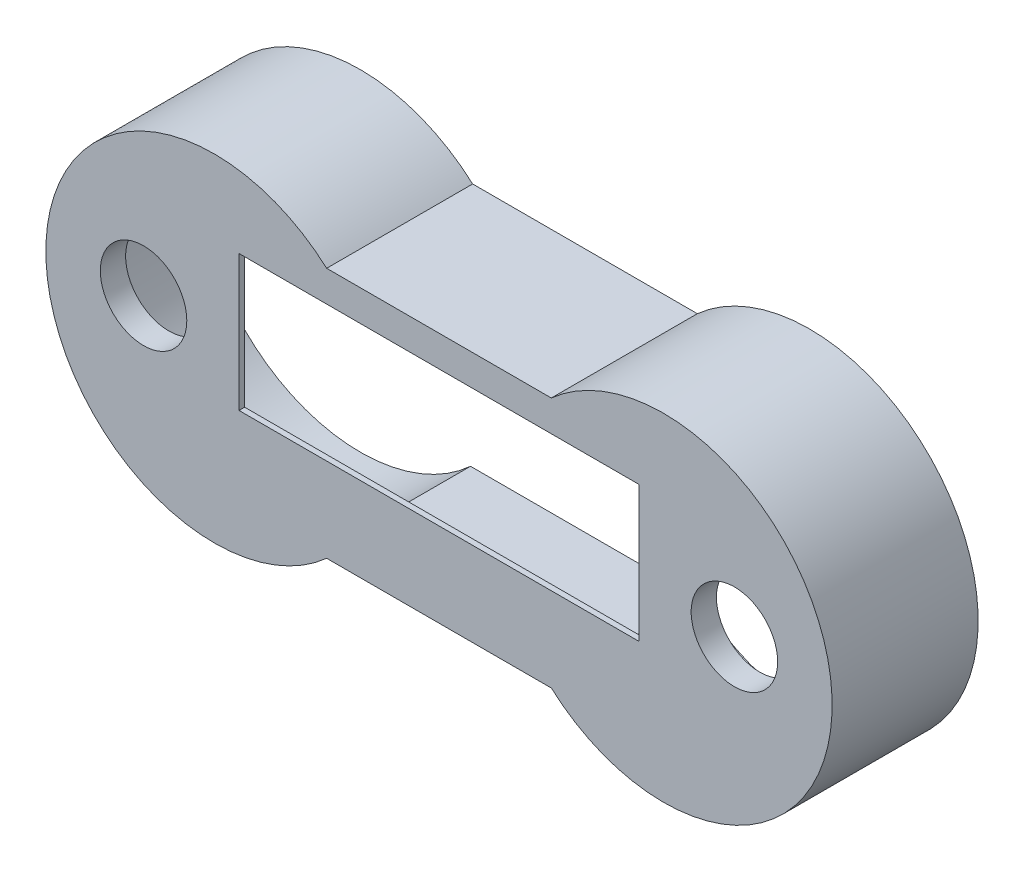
ISO-10303-21;
HEADER;
FILE_DESCRIPTION(('STEP AP214'),'2;1');
FILE_NAME('part.step','',(''),(''),'','','');
FILE_SCHEMA(('AUTOMOTIVE_DESIGN { 1 0 10303 214 1 1 1 1 }'));
ENDSEC;
DATA;
#1=APPLICATION_CONTEXT('core data for automotive mechanical design processes');
#2=APPLICATION_PROTOCOL_DEFINITION('international standard','automotive_design',2000,#1);
#3=PRODUCT_CONTEXT('',#1,'mechanical');
#4=PRODUCT('Part','Part','',(#3));
#5=PRODUCT_RELATED_PRODUCT_CATEGORY('part','',(#4));
#6=PRODUCT_DEFINITION_FORMATION('','',#4);
#7=PRODUCT_DEFINITION_CONTEXT('part definition',#1,'design');
#8=PRODUCT_DEFINITION('design','',#6,#7);
#9=PRODUCT_DEFINITION_SHAPE('','',#8);
#10=(LENGTH_UNIT() NAMED_UNIT(*) SI_UNIT(.MILLI.,.METRE.));
#11=(NAMED_UNIT(*) PLANE_ANGLE_UNIT() SI_UNIT($,.RADIAN.));
#12=(NAMED_UNIT(*) SI_UNIT($,.STERADIAN.) SOLID_ANGLE_UNIT());
#13=UNCERTAINTY_MEASURE_WITH_UNIT(LENGTH_MEASURE(1.E-05),#10,'distance_accuracy_value','');
#14=(GEOMETRIC_REPRESENTATION_CONTEXT(3) GLOBAL_UNCERTAINTY_ASSIGNED_CONTEXT((#13)) GLOBAL_UNIT_ASSIGNED_CONTEXT((#10,
#11,#12)) REPRESENTATION_CONTEXT('',''));
#15=CARTESIAN_POINT('',(0.,0.,0.));
#16=DIRECTION('',(0.,0.,1.));
#17=DIRECTION('',(1.,0.,0.));
#18=AXIS2_PLACEMENT_3D('',#15,#16,#17);
#19=CARTESIAN_POINT('',(30.,29.8606797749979,25.));
#20=DIRECTION('',(0.,0.,1.));
#21=DIRECTION('',(1.,0.,0.));
#22=AXIS2_PLACEMENT_3D('',#19,#20,#21);
#23=PLANE('',#22);
#24=CARTESIAN_POINT('',(122.6,31.7,25.));
#25=DIRECTION('',(0.,0.,1.));
#26=DIRECTION('',(1.,0.,0.));
#27=AXIS2_PLACEMENT_3D('',#24,#25,#26);
#28=CIRCLE('',#27,8.7);
#29=CARTESIAN_POINT('',(131.3,31.7,25.));
#30=VERTEX_POINT('',#29);
#31=EDGE_CURVE('E40',#30,#30,#28,.F.);
#32=ORIENTED_EDGE('',*,*,#31,.F.);
#33=EDGE_LOOP('',(#32));
#34=FACE_BOUND('',#33,.T.);
#35=DIRECTION('',(-1.,0.,0.));
#36=VECTOR('',#35,1.);
#37=CARTESIAN_POINT('',(30.,46.7,25.));
#38=LINE('',#37,#36);
#39=CARTESIAN_POINT('',(105.6,46.7,25.));
#40=VERTEX_POINT('',#39);
#41=CARTESIAN_POINT('',(34.4,46.7,25.));
#42=VERTEX_POINT('',#41);
#43=EDGE_CURVE('E152',#40,#42,#38,.T.);
#44=ORIENTED_EDGE('',*,*,#43,.T.);
#45=DIRECTION('',(0.,-1.,0.));
#46=VECTOR('',#45,1.);
#47=CARTESIAN_POINT('',(34.4,29.8606797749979,25.));
#48=LINE('',#47,#46);
#49=CARTESIAN_POINT('',(34.4,22.5,25.));
#50=VERTEX_POINT('',#49);
#51=EDGE_CURVE('E155',#42,#50,#48,.T.);
#52=ORIENTED_EDGE('',*,*,#51,.T.);
#53=DIRECTION('',(1.,0.,0.));
#54=VECTOR('',#53,1.);
#55=CARTESIAN_POINT('',(30.,22.5,25.));
#56=LINE('',#55,#54);
#57=CARTESIAN_POINT('',(105.6,22.5,25.));
#58=VERTEX_POINT('',#57);
#59=EDGE_CURVE('E147',#50,#58,#56,.T.);
#60=ORIENTED_EDGE('',*,*,#59,.T.);
#61=DIRECTION('',(0.,1.,0.));
#62=VECTOR('',#61,1.);
#63=CARTESIAN_POINT('',(105.6,29.8606797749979,25.));
#64=LINE('',#63,#62);
#65=EDGE_CURVE('E127',#58,#40,#64,.T.);
#66=ORIENTED_EDGE('',*,*,#65,.T.);
#67=EDGE_LOOP('',(#44,#52,#60,#66));
#68=FACE_BOUND('',#67,.T.);
#69=CARTESIAN_POINT('',(30.,29.8606797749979,25.));
#70=DIRECTION('',(0.,0.,1.));
#71=DIRECTION('',(1.,0.,0.));
#72=AXIS2_PLACEMENT_3D('',#69,#70,#71);
#73=CIRCLE('',#72,29.);
#74=CARTESIAN_POINT('',(49.6143151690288,51.2213595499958,25.));
#75=VERTEX_POINT('',#74);
#76=CARTESIAN_POINT('',(49.6143151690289,8.5,25.));
#77=VERTEX_POINT('',#76);
#78=EDGE_CURVE('E171',#75,#77,#73,.T.);
#79=ORIENTED_EDGE('',*,*,#78,.F.);
#80=DIRECTION('',(-1.,0.,0.));
#81=VECTOR('',#80,1.);
#82=CARTESIAN_POINT('',(49.6143151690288,51.2213595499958,25.));
#83=LINE('',#82,#81);
#84=CARTESIAN_POINT('',(90.3856848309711,51.2213595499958,25.));
#85=VERTEX_POINT('',#84);
#86=EDGE_CURVE('E181',#85,#75,#83,.T.);
#87=ORIENTED_EDGE('',*,*,#86,.F.);
#88=CARTESIAN_POINT('',(110.,29.8606797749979,25.));
#89=DIRECTION('',(0.,0.,1.));
#90=DIRECTION('',(-1.,0.,0.));
#91=AXIS2_PLACEMENT_3D('',#88,#89,#90);
#92=CIRCLE('',#91,29.);
#93=CARTESIAN_POINT('',(90.3856848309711,8.5,25.));
#94=VERTEX_POINT('',#93);
#95=EDGE_CURVE('E178',#94,#85,#92,.T.);
#96=ORIENTED_EDGE('',*,*,#95,.F.);
#97=DIRECTION('',(1.,0.,0.));
#98=VECTOR('',#97,1.);
#99=CARTESIAN_POINT('',(49.6143151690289,8.5,25.));
#100=LINE('',#99,#98);
#101=EDGE_CURVE('E174',#77,#94,#100,.T.);
#102=ORIENTED_EDGE('',*,*,#101,.F.);
#103=EDGE_LOOP('',(#79,#87,#96,#102));
#104=FACE_BOUND('',#103,.T.);
#105=CARTESIAN_POINT('',(17.4,31.7,25.));
#106=DIRECTION('',(0.,0.,1.));
#107=DIRECTION('',(1.,0.,0.));
#108=AXIS2_PLACEMENT_3D('',#105,#106,#107);
#109=CIRCLE('',#108,8.7);
#110=CARTESIAN_POINT('',(26.1,31.7,25.));
#111=VERTEX_POINT('',#110);
#112=EDGE_CURVE('E11',#111,#111,#109,.F.);
#113=ORIENTED_EDGE('',*,*,#112,.F.);
#114=EDGE_LOOP('',(#113));
#115=FACE_BOUND('',#114,.T.);
#116=ADVANCED_FACE('F32',(#34,#68,#104,#115),#23,.F.);
#117=CARTESIAN_POINT('',(30.,29.8606797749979,0.));
#118=DIRECTION('',(0.,0.,1.));
#119=DIRECTION('',(1.,0.,0.));
#120=AXIS2_PLACEMENT_3D('',#117,#118,#119);
#121=PLANE('',#120);
#122=CARTESIAN_POINT('',(30.,29.8606797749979,0.));
#123=DIRECTION('',(0.,0.,1.));
#124=DIRECTION('',(1.,0.,0.));
#125=AXIS2_PLACEMENT_3D('',#122,#123,#124);
#126=CIRCLE('',#125,30.);
#127=CARTESIAN_POINT('',(50.,52.2213595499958,0.));
#128=VERTEX_POINT('',#127);
#129=CARTESIAN_POINT('',(50.,7.5,0.));
#130=VERTEX_POINT('',#129);
#131=EDGE_CURVE('E204',#128,#130,#126,.T.);
#132=ORIENTED_EDGE('',*,*,#131,.F.);
#133=DIRECTION('',(-1.,0.,0.));
#134=VECTOR('',#133,1.);
#135=CARTESIAN_POINT('',(50.,52.2213595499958,0.));
#136=LINE('',#135,#134);
#137=CARTESIAN_POINT('',(90.,52.2213595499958,0.));
#138=VERTEX_POINT('',#137);
#139=EDGE_CURVE('E211',#138,#128,#136,.T.);
#140=ORIENTED_EDGE('',*,*,#139,.F.);
#141=CARTESIAN_POINT('',(110.,29.8606797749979,0.));
#142=DIRECTION('',(0.,0.,1.));
#143=DIRECTION('',(-1.,0.,0.));
#144=AXIS2_PLACEMENT_3D('',#141,#142,#143);
#145=CIRCLE('',#144,30.);
#146=CARTESIAN_POINT('',(90.,7.5,0.));
#147=VERTEX_POINT('',#146);
#148=EDGE_CURVE('E209',#147,#138,#145,.T.);
#149=ORIENTED_EDGE('',*,*,#148,.F.);
#150=DIRECTION('',(1.,0.,0.));
#151=VECTOR('',#150,1.);
#152=CARTESIAN_POINT('',(50.,7.5,0.));
#153=LINE('',#152,#151);
#154=EDGE_CURVE('E207',#130,#147,#153,.T.);
#155=ORIENTED_EDGE('',*,*,#154,.F.);
#156=EDGE_LOOP('',(#132,#140,#149,#155));
#157=FACE_BOUND('',#156,.T.);
#158=CARTESIAN_POINT('',(30.,29.8606797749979,0.));
#159=DIRECTION('',(0.,0.,1.));
#160=DIRECTION('',(1.,0.,0.));
#161=AXIS2_PLACEMENT_3D('',#158,#159,#160);
#162=CIRCLE('',#161,29.);
#163=CARTESIAN_POINT('',(49.6143151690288,51.2213595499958,0.));
#164=VERTEX_POINT('',#163);
#165=CARTESIAN_POINT('',(49.6143151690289,8.5,0.));
#166=VERTEX_POINT('',#165);
#167=EDGE_CURVE('E170',#164,#166,#162,.T.);
#168=ORIENTED_EDGE('',*,*,#167,.T.);
#169=DIRECTION('',(1.,0.,0.));
#170=VECTOR('',#169,1.);
#171=CARTESIAN_POINT('',(49.6143151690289,8.5,0.));
#172=LINE('',#171,#170);
#173=CARTESIAN_POINT('',(90.3856848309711,8.50000000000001,0.));
#174=VERTEX_POINT('',#173);
#175=EDGE_CURVE('E187',#166,#174,#172,.T.);
#176=ORIENTED_EDGE('',*,*,#175,.T.);
#177=CARTESIAN_POINT('',(110.,29.8606797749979,0.));
#178=DIRECTION('',(0.,0.,1.));
#179=DIRECTION('',(-1.,0.,0.));
#180=AXIS2_PLACEMENT_3D('',#177,#178,#179);
#181=CIRCLE('',#180,29.);
#182=CARTESIAN_POINT('',(90.3856848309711,51.2213595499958,0.));
#183=VERTEX_POINT('',#182);
#184=EDGE_CURVE('E190',#174,#183,#181,.T.);
#185=ORIENTED_EDGE('',*,*,#184,.T.);
#186=DIRECTION('',(-1.,0.,0.));
#187=VECTOR('',#186,1.);
#188=CARTESIAN_POINT('',(49.6143151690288,51.2213595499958,0.));
#189=LINE('',#188,#187);
#190=EDGE_CURVE('E175',#183,#164,#189,.T.);
#191=ORIENTED_EDGE('',*,*,#190,.T.);
#192=EDGE_LOOP('',(#168,#176,#185,#191));
#193=FACE_BOUND('',#192,.T.);
#194=ADVANCED_FACE('F231',(#157,#193),#121,.F.);
#195=CARTESIAN_POINT('',(30.,29.8606797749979,25.));
#196=DIRECTION('',(0.,0.,-1.));
#197=DIRECTION('',(-1.,0.,0.));
#198=AXIS2_PLACEMENT_3D('',#195,#196,#197);
#199=CYLINDRICAL_SURFACE('',#198,30.);
#200=ORIENTED_EDGE('',*,*,#131,.T.);
#201=DIRECTION('',(0.,0.,-1.));
#202=VECTOR('',#201,1.);
#203=CARTESIAN_POINT('',(50.,7.5,25.));
#204=LINE('',#203,#202);
#205=CARTESIAN_POINT('',(50.,7.5,26.));
#206=VERTEX_POINT('',#205);
#207=EDGE_CURVE('E222',#206,#130,#204,.T.);
#208=ORIENTED_EDGE('',*,*,#207,.F.);
#209=CARTESIAN_POINT('',(30.,29.8606797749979,26.));
#210=DIRECTION('',(0.,0.,1.));
#211=DIRECTION('',(1.,0.,0.));
#212=AXIS2_PLACEMENT_3D('',#209,#210,#211);
#213=CIRCLE('',#212,30.);
#214=CARTESIAN_POINT('',(50.,52.2213595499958,26.));
#215=VERTEX_POINT('',#214);
#216=EDGE_CURVE('E158',#215,#206,#213,.T.);
#217=ORIENTED_EDGE('',*,*,#216,.F.);
#218=DIRECTION('',(0.,0.,-1.));
#219=VECTOR('',#218,1.);
#220=CARTESIAN_POINT('',(50.,52.2213595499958,25.));
#221=LINE('',#220,#219);
#222=EDGE_CURVE('E213',#215,#128,#221,.T.);
#223=ORIENTED_EDGE('',*,*,#222,.T.);
#224=EDGE_LOOP('',(#200,#208,#217,#223));
#225=FACE_BOUND('',#224,.T.);
#226=ADVANCED_FACE('F34',(#225),#199,.T.);
#227=CARTESIAN_POINT('',(50.,7.5,25.));
#228=DIRECTION('',(0.,1.,0.));
#229=DIRECTION('',(0.,0.,1.));
#230=AXIS2_PLACEMENT_3D('',#227,#228,#229);
#231=PLANE('',#230);
#232=ORIENTED_EDGE('',*,*,#154,.T.);
#233=DIRECTION('',(0.,0.,-1.));
#234=VECTOR('',#233,1.);
#235=CARTESIAN_POINT('',(90.,7.5,25.));
#236=LINE('',#235,#234);
#237=CARTESIAN_POINT('',(90.,7.5,26.));
#238=VERTEX_POINT('',#237);
#239=EDGE_CURVE('E219',#238,#147,#236,.T.);
#240=ORIENTED_EDGE('',*,*,#239,.F.);
#241=DIRECTION('',(1.,0.,0.));
#242=VECTOR('',#241,1.);
#243=CARTESIAN_POINT('',(50.,7.5,26.));
#244=LINE('',#243,#242);
#245=EDGE_CURVE('E161',#206,#238,#244,.T.);
#246=ORIENTED_EDGE('',*,*,#245,.F.);
#247=ORIENTED_EDGE('',*,*,#207,.T.);
#248=EDGE_LOOP('',(#232,#240,#246,#247));
#249=FACE_BOUND('',#248,.T.);
#250=ADVANCED_FACE('F303',(#249),#231,.F.);
#251=CARTESIAN_POINT('',(110.,29.8606797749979,25.));
#252=DIRECTION('',(0.,0.,-1.));
#253=DIRECTION('',(-1.,0.,0.));
#254=AXIS2_PLACEMENT_3D('',#251,#252,#253);
#255=CYLINDRICAL_SURFACE('',#254,30.);
#256=ORIENTED_EDGE('',*,*,#148,.T.);
#257=DIRECTION('',(0.,0.,-1.));
#258=VECTOR('',#257,1.);
#259=CARTESIAN_POINT('',(90.,52.2213595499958,25.));
#260=LINE('',#259,#258);
#261=CARTESIAN_POINT('',(90.,52.2213595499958,26.));
#262=VERTEX_POINT('',#261);
#263=EDGE_CURVE('E216',#262,#138,#260,.T.);
#264=ORIENTED_EDGE('',*,*,#263,.F.);
#265=CARTESIAN_POINT('',(110.,29.8606797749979,26.));
#266=DIRECTION('',(0.,0.,1.));
#267=DIRECTION('',(1.,0.,0.));
#268=AXIS2_PLACEMENT_3D('',#265,#266,#267);
#269=CIRCLE('',#268,30.);
#270=EDGE_CURVE('E164',#238,#262,#269,.T.);
#271=ORIENTED_EDGE('',*,*,#270,.F.);
#272=ORIENTED_EDGE('',*,*,#239,.T.);
#273=EDGE_LOOP('',(#256,#264,#271,#272));
#274=FACE_BOUND('',#273,.T.);
#275=ADVANCED_FACE('F300',(#274),#255,.T.);
#276=CARTESIAN_POINT('',(50.,52.2213595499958,25.));
#277=DIRECTION('',(0.,-1.,0.));
#278=DIRECTION('',(0.,0.,-1.));
#279=AXIS2_PLACEMENT_3D('',#276,#277,#278);
#280=PLANE('',#279);
#281=ORIENTED_EDGE('',*,*,#139,.T.);
#282=ORIENTED_EDGE('',*,*,#222,.F.);
#283=DIRECTION('',(-1.,0.,0.));
#284=VECTOR('',#283,1.);
#285=CARTESIAN_POINT('',(90.,52.2213595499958,26.));
#286=LINE('',#285,#284);
#287=EDGE_CURVE('E167',#262,#215,#286,.T.);
#288=ORIENTED_EDGE('',*,*,#287,.F.);
#289=ORIENTED_EDGE('',*,*,#263,.T.);
#290=EDGE_LOOP('',(#281,#282,#288,#289));
#291=FACE_BOUND('',#290,.T.);
#292=ADVANCED_FACE('F293',(#291),#280,.F.);
#293=CARTESIAN_POINT('',(30.,29.8606797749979,25.));
#294=DIRECTION('',(0.,0.,-1.));
#295=DIRECTION('',(-1.,0.,0.));
#296=AXIS2_PLACEMENT_3D('',#293,#294,#295);
#297=CYLINDRICAL_SURFACE('',#296,29.);
#298=ORIENTED_EDGE('',*,*,#167,.F.);
#299=DIRECTION('',(0.,0.,-1.));
#300=VECTOR('',#299,1.);
#301=CARTESIAN_POINT('',(49.6143151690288,51.2213595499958,25.));
#302=LINE('',#301,#300);
#303=EDGE_CURVE('E184',#75,#164,#302,.T.);
#304=ORIENTED_EDGE('',*,*,#303,.F.);
#305=ORIENTED_EDGE('',*,*,#78,.T.);
#306=DIRECTION('',(0.,0.,-1.));
#307=VECTOR('',#306,1.);
#308=CARTESIAN_POINT('',(49.6143151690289,8.5,25.));
#309=LINE('',#308,#307);
#310=EDGE_CURVE('E201',#77,#166,#309,.T.);
#311=ORIENTED_EDGE('',*,*,#310,.T.);
#312=EDGE_LOOP('',(#298,#304,#305,#311));
#313=FACE_BOUND('',#312,.T.);
#314=ADVANCED_FACE('F289',(#313),#297,.F.);
#315=CARTESIAN_POINT('',(49.6143151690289,8.5,25.));
#316=DIRECTION('',(0.,1.,0.));
#317=DIRECTION('',(0.,0.,1.));
#318=AXIS2_PLACEMENT_3D('',#315,#316,#317);
#319=PLANE('',#318);
#320=ORIENTED_EDGE('',*,*,#175,.F.);
#321=ORIENTED_EDGE('',*,*,#310,.F.);
#322=ORIENTED_EDGE('',*,*,#101,.T.);
#323=DIRECTION('',(0.,0.,-1.));
#324=VECTOR('',#323,1.);
#325=CARTESIAN_POINT('',(90.3856848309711,8.50000000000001,25.));
#326=LINE('',#325,#324);
#327=EDGE_CURVE('E199',#94,#174,#326,.T.);
#328=ORIENTED_EDGE('',*,*,#327,.T.);
#329=EDGE_LOOP('',(#320,#321,#322,#328));
#330=FACE_BOUND('',#329,.T.);
#331=ADVANCED_FACE('F285',(#330),#319,.T.);
#332=CARTESIAN_POINT('',(110.,29.8606797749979,25.));
#333=DIRECTION('',(0.,0.,-1.));
#334=DIRECTION('',(-1.,0.,0.));
#335=AXIS2_PLACEMENT_3D('',#332,#333,#334);
#336=CYLINDRICAL_SURFACE('',#335,29.);
#337=ORIENTED_EDGE('',*,*,#184,.F.);
#338=ORIENTED_EDGE('',*,*,#327,.F.);
#339=ORIENTED_EDGE('',*,*,#95,.T.);
#340=DIRECTION('',(0.,0.,-1.));
#341=VECTOR('',#340,1.);
#342=CARTESIAN_POINT('',(90.3856848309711,51.2213595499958,25.));
#343=LINE('',#342,#341);
#344=EDGE_CURVE('E197',#85,#183,#343,.T.);
#345=ORIENTED_EDGE('',*,*,#344,.T.);
#346=EDGE_LOOP('',(#337,#338,#339,#345));
#347=FACE_BOUND('',#346,.T.);
#348=ADVANCED_FACE('F281',(#347),#336,.F.);
#349=CARTESIAN_POINT('',(49.6143151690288,51.2213595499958,25.));
#350=DIRECTION('',(0.,-1.,0.));
#351=DIRECTION('',(0.,0.,-1.));
#352=AXIS2_PLACEMENT_3D('',#349,#350,#351);
#353=PLANE('',#352);
#354=ORIENTED_EDGE('',*,*,#190,.F.);
#355=ORIENTED_EDGE('',*,*,#344,.F.);
#356=ORIENTED_EDGE('',*,*,#86,.T.);
#357=ORIENTED_EDGE('',*,*,#303,.T.);
#358=EDGE_LOOP('',(#354,#355,#356,#357));
#359=FACE_BOUND('',#358,.T.);
#360=ADVANCED_FACE('F276',(#359),#353,.T.);
#361=CARTESIAN_POINT('',(30.,29.8606797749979,26.));
#362=DIRECTION('',(0.,0.,1.));
#363=DIRECTION('',(1.,0.,0.));
#364=AXIS2_PLACEMENT_3D('',#361,#362,#363);
#365=PLANE('',#364);
#366=CARTESIAN_POINT('',(122.6,31.7,26.));
#367=DIRECTION('',(0.,0.,1.));
#368=DIRECTION('',(1.,0.,0.));
#369=AXIS2_PLACEMENT_3D('',#366,#367,#368);
#370=CIRCLE('',#369,7.69999999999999);
#371=CARTESIAN_POINT('',(130.3,31.7,26.));
#372=VERTEX_POINT('',#371);
#373=EDGE_CURVE('E468',#372,#372,#370,.T.);
#374=ORIENTED_EDGE('',*,*,#373,.F.);
#375=EDGE_LOOP('',(#374));
#376=FACE_BOUND('',#375,.T.);
#377=CARTESIAN_POINT('',(17.4,31.7,26.));
#378=DIRECTION('',(0.,0.,1.));
#379=DIRECTION('',(1.,0.,0.));
#380=AXIS2_PLACEMENT_3D('',#377,#378,#379);
#381=CIRCLE('',#380,7.69999999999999);
#382=CARTESIAN_POINT('',(25.1,31.7,26.));
#383=VERTEX_POINT('',#382);
#384=EDGE_CURVE('E471',#383,#383,#381,.T.);
#385=ORIENTED_EDGE('',*,*,#384,.F.);
#386=EDGE_LOOP('',(#385));
#387=FACE_BOUND('',#386,.T.);
#388=DIRECTION('',(0.,-1.,0.));
#389=VECTOR('',#388,1.);
#390=CARTESIAN_POINT('',(34.4,46.7,26.));
#391=LINE('',#390,#389);
#392=CARTESIAN_POINT('',(34.4,46.7,26.));
#393=VERTEX_POINT('',#392);
#394=CARTESIAN_POINT('',(34.4,22.5,26.));
#395=VERTEX_POINT('',#394);
#396=EDGE_CURVE('E55',#393,#395,#391,.T.);
#397=ORIENTED_EDGE('',*,*,#396,.F.);
#398=DIRECTION('',(-1.,0.,0.));
#399=VECTOR('',#398,1.);
#400=CARTESIAN_POINT('',(34.4,46.7,26.));
#401=LINE('',#400,#399);
#402=CARTESIAN_POINT('',(105.6,46.7,26.));
#403=VERTEX_POINT('',#402);
#404=EDGE_CURVE('E140',#403,#393,#401,.T.);
#405=ORIENTED_EDGE('',*,*,#404,.F.);
#406=DIRECTION('',(0.,1.,0.));
#407=VECTOR('',#406,1.);
#408=CARTESIAN_POINT('',(105.6,46.7,26.));
#409=LINE('',#408,#407);
#410=CARTESIAN_POINT('',(105.6,22.5,26.));
#411=VERTEX_POINT('',#410);
#412=EDGE_CURVE('E124',#411,#403,#409,.T.);
#413=ORIENTED_EDGE('',*,*,#412,.F.);
#414=DIRECTION('',(1.,0.,0.));
#415=VECTOR('',#414,1.);
#416=CARTESIAN_POINT('',(34.4,22.5,26.));
#417=LINE('',#416,#415);
#418=EDGE_CURVE('E133',#395,#411,#417,.T.);
#419=ORIENTED_EDGE('',*,*,#418,.F.);
#420=EDGE_LOOP('',(#397,#405,#413,#419));
#421=FACE_BOUND('',#420,.T.);
#422=ORIENTED_EDGE('',*,*,#216,.T.);
#423=ORIENTED_EDGE('',*,*,#245,.T.);
#424=ORIENTED_EDGE('',*,*,#270,.T.);
#425=ORIENTED_EDGE('',*,*,#287,.T.);
#426=EDGE_LOOP('',(#422,#423,#424,#425));
#427=FACE_BOUND('',#426,.T.);
#428=ADVANCED_FACE('F137',(#376,#387,#421,#427),#365,.T.);
#429=CARTESIAN_POINT('',(34.4,46.7,0.));
#430=DIRECTION('',(-1.,0.,0.));
#431=DIRECTION('',(0.,0.,1.));
#432=AXIS2_PLACEMENT_3D('',#429,#430,#431);
#433=PLANE('',#432);
#434=DIRECTION('',(0.,0.,1.));
#435=VECTOR('',#434,1.);
#436=CARTESIAN_POINT('',(34.4,46.7,0.));
#437=LINE('',#436,#435);
#438=EDGE_CURVE('E145',#42,#393,#437,.T.);
#439=ORIENTED_EDGE('',*,*,#438,.T.);
#440=ORIENTED_EDGE('',*,*,#396,.T.);
#441=DIRECTION('',(0.,0.,1.));
#442=VECTOR('',#441,1.);
#443=CARTESIAN_POINT('',(34.4,22.5,0.));
#444=LINE('',#443,#442);
#445=EDGE_CURVE('E130',#50,#395,#444,.T.);
#446=ORIENTED_EDGE('',*,*,#445,.F.);
#447=ORIENTED_EDGE('',*,*,#51,.F.);
#448=EDGE_LOOP('',(#439,#440,#446,#447));
#449=FACE_BOUND('',#448,.T.);
#450=ADVANCED_FACE('F267',(#449),#433,.F.);
#451=CARTESIAN_POINT('',(34.4,46.7,0.));
#452=DIRECTION('',(0.,1.,0.));
#453=DIRECTION('',(0.,0.,1.));
#454=AXIS2_PLACEMENT_3D('',#451,#452,#453);
#455=PLANE('',#454);
#456=DIRECTION('',(0.,0.,1.));
#457=VECTOR('',#456,1.);
#458=CARTESIAN_POINT('',(105.6,46.7,0.));
#459=LINE('',#458,#457);
#460=EDGE_CURVE('E129',#40,#403,#459,.T.);
#461=ORIENTED_EDGE('',*,*,#460,.T.);
#462=ORIENTED_EDGE('',*,*,#404,.T.);
#463=ORIENTED_EDGE('',*,*,#438,.F.);
#464=ORIENTED_EDGE('',*,*,#43,.F.);
#465=EDGE_LOOP('',(#461,#462,#463,#464));
#466=FACE_BOUND('',#465,.T.);
#467=ADVANCED_FACE('F264',(#466),#455,.F.);
#468=CARTESIAN_POINT('',(105.6,46.7,0.));
#469=DIRECTION('',(1.,0.,0.));
#470=DIRECTION('',(0.,0.,-1.));
#471=AXIS2_PLACEMENT_3D('',#468,#469,#470);
#472=PLANE('',#471);
#473=DIRECTION('',(0.,0.,1.));
#474=VECTOR('',#473,1.);
#475=CARTESIAN_POINT('',(105.6,22.5,0.));
#476=LINE('',#475,#474);
#477=EDGE_CURVE('E47',#58,#411,#476,.T.);
#478=ORIENTED_EDGE('',*,*,#477,.T.);
#479=ORIENTED_EDGE('',*,*,#412,.T.);
#480=ORIENTED_EDGE('',*,*,#460,.F.);
#481=ORIENTED_EDGE('',*,*,#65,.F.);
#482=EDGE_LOOP('',(#478,#479,#480,#481));
#483=FACE_BOUND('',#482,.T.);
#484=ADVANCED_FACE('F121',(#483),#472,.F.);
#485=CARTESIAN_POINT('',(34.4,22.5,0.));
#486=DIRECTION('',(0.,-1.,0.));
#487=DIRECTION('',(0.,0.,-1.));
#488=AXIS2_PLACEMENT_3D('',#485,#486,#487);
#489=PLANE('',#488);
#490=ORIENTED_EDGE('',*,*,#445,.T.);
#491=ORIENTED_EDGE('',*,*,#418,.T.);
#492=ORIENTED_EDGE('',*,*,#477,.F.);
#493=ORIENTED_EDGE('',*,*,#59,.F.);
#494=EDGE_LOOP('',(#490,#491,#492,#493));
#495=FACE_BOUND('',#494,.T.);
#496=ADVANCED_FACE('F134',(#495),#489,.F.);
#497=CARTESIAN_POINT('',(17.4,31.7,0.));
#498=DIRECTION('',(0.,0.,1.));
#499=DIRECTION('',(1.,0.,0.));
#500=AXIS2_PLACEMENT_3D('',#497,#498,#499);
#501=CYLINDRICAL_SURFACE('',#500,7.69999999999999);
#502=ORIENTED_EDGE('',*,*,#384,.T.);
#503=EDGE_LOOP('',(#502));
#504=FACE_BOUND('',#503,.T.);
#505=CARTESIAN_POINT('',(17.4,31.7,21.5));
#506=DIRECTION('',(0.,0.,-1.));
#507=DIRECTION('',(-1.,0.,0.));
#508=AXIS2_PLACEMENT_3D('',#505,#506,#507);
#509=CIRCLE('',#508,7.7);
#510=CARTESIAN_POINT('',(9.7,31.7,21.5));
#511=VERTEX_POINT('',#510);
#512=EDGE_CURVE('E484',#511,#511,#509,.T.);
#513=ORIENTED_EDGE('',*,*,#512,.T.);
#514=EDGE_LOOP('',(#513));
#515=FACE_BOUND('',#514,.T.);
#516=ADVANCED_FACE('F259',(#504,#515),#501,.F.);
#517=CARTESIAN_POINT('',(122.6,31.7,0.));
#518=DIRECTION('',(0.,0.,1.));
#519=DIRECTION('',(1.,0.,0.));
#520=AXIS2_PLACEMENT_3D('',#517,#518,#519);
#521=CYLINDRICAL_SURFACE('',#520,7.69999999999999);
#522=ORIENTED_EDGE('',*,*,#373,.T.);
#523=EDGE_LOOP('',(#522));
#524=FACE_BOUND('',#523,.T.);
#525=CARTESIAN_POINT('',(122.6,31.7,21.5));
#526=DIRECTION('',(0.,0.,-1.));
#527=DIRECTION('',(-1.,0.,0.));
#528=AXIS2_PLACEMENT_3D('',#525,#526,#527);
#529=CIRCLE('',#528,7.7);
#530=CARTESIAN_POINT('',(114.9,31.7,21.5));
#531=VERTEX_POINT('',#530);
#532=EDGE_CURVE('E478',#531,#531,#529,.T.);
#533=ORIENTED_EDGE('',*,*,#532,.T.);
#534=EDGE_LOOP('',(#533));
#535=FACE_BOUND('',#534,.T.);
#536=ADVANCED_FACE('F252',(#524,#535),#521,.F.);
#537=CARTESIAN_POINT('',(122.6,31.7,21.5));
#538=DIRECTION('',(0.,0.,-1.));
#539=DIRECTION('',(-1.,0.,0.));
#540=AXIS2_PLACEMENT_3D('',#537,#538,#539);
#541=PLANE('',#540);
#542=CARTESIAN_POINT('',(122.6,31.7,21.5));
#543=DIRECTION('',(0.,0.,-1.));
#544=DIRECTION('',(-1.,0.,0.));
#545=AXIS2_PLACEMENT_3D('',#542,#543,#544);
#546=CIRCLE('',#545,8.7);
#547=CARTESIAN_POINT('',(113.9,31.7,21.5));
#548=VERTEX_POINT('',#547);
#549=EDGE_CURVE('E473',#548,#548,#546,.T.);
#550=ORIENTED_EDGE('',*,*,#549,.T.);
#551=EDGE_LOOP('',(#550));
#552=FACE_BOUND('',#551,.T.);
#553=ORIENTED_EDGE('',*,*,#532,.F.);
#554=EDGE_LOOP('',(#553));
#555=FACE_BOUND('',#554,.T.);
#556=ADVANCED_FACE('F249',(#552,#555),#541,.T.);
#557=CARTESIAN_POINT('',(122.6,31.7,21.5));
#558=DIRECTION('',(0.,0.,1.));
#559=DIRECTION('',(1.,0.,0.));
#560=AXIS2_PLACEMENT_3D('',#557,#558,#559);
#561=CYLINDRICAL_SURFACE('',#560,8.7);
#562=ORIENTED_EDGE('',*,*,#549,.F.);
#563=EDGE_LOOP('',(#562));
#564=FACE_BOUND('',#563,.T.);
#565=ORIENTED_EDGE('',*,*,#31,.T.);
#566=EDGE_LOOP('',(#565));
#567=FACE_BOUND('',#566,.T.);
#568=ADVANCED_FACE('F227',(#564,#567),#561,.T.);
#569=CARTESIAN_POINT('',(17.4,31.7,21.5));
#570=DIRECTION('',(0.,0.,-1.));
#571=DIRECTION('',(-1.,0.,0.));
#572=AXIS2_PLACEMENT_3D('',#569,#570,#571);
#573=PLANE('',#572);
#574=CARTESIAN_POINT('',(17.4,31.7,21.5));
#575=DIRECTION('',(0.,0.,-1.));
#576=DIRECTION('',(-1.,0.,0.));
#577=AXIS2_PLACEMENT_3D('',#574,#575,#576);
#578=CIRCLE('',#577,8.7);
#579=CARTESIAN_POINT('',(8.7,31.7,21.5));
#580=VERTEX_POINT('',#579);
#581=EDGE_CURVE('E481',#580,#580,#578,.T.);
#582=ORIENTED_EDGE('',*,*,#581,.T.);
#583=EDGE_LOOP('',(#582));
#584=FACE_BOUND('',#583,.T.);
#585=ORIENTED_EDGE('',*,*,#512,.F.);
#586=EDGE_LOOP('',(#585));
#587=FACE_BOUND('',#586,.T.);
#588=ADVANCED_FACE('F239',(#584,#587),#573,.T.);
#589=CARTESIAN_POINT('',(17.4,31.7,21.5));
#590=DIRECTION('',(0.,0.,1.));
#591=DIRECTION('',(1.,0.,0.));
#592=AXIS2_PLACEMENT_3D('',#589,#590,#591);
#593=CYLINDRICAL_SURFACE('',#592,8.7);
#594=ORIENTED_EDGE('',*,*,#581,.F.);
#595=EDGE_LOOP('',(#594));
#596=FACE_BOUND('',#595,.T.);
#597=ORIENTED_EDGE('',*,*,#112,.T.);
#598=EDGE_LOOP('',(#597));
#599=FACE_BOUND('',#598,.T.);
#600=ADVANCED_FACE('F237',(#596,#599),#593,.T.);
#601=CLOSED_SHELL('',(#116,#194,#226,#250,#275,#292,#314,#331,#348,#360,#428,#450,#467,#484,
#496,#516,#536,#556,#568,#588,#600));
#602=MANIFOLD_SOLID_BREP('B2',#601);
#603=ADVANCED_BREP_SHAPE_REPRESENTATION('',(#18,#602),#14);
#604=SHAPE_DEFINITION_REPRESENTATION(#9,#603);
ENDSEC;
END-ISO-10303-21;
